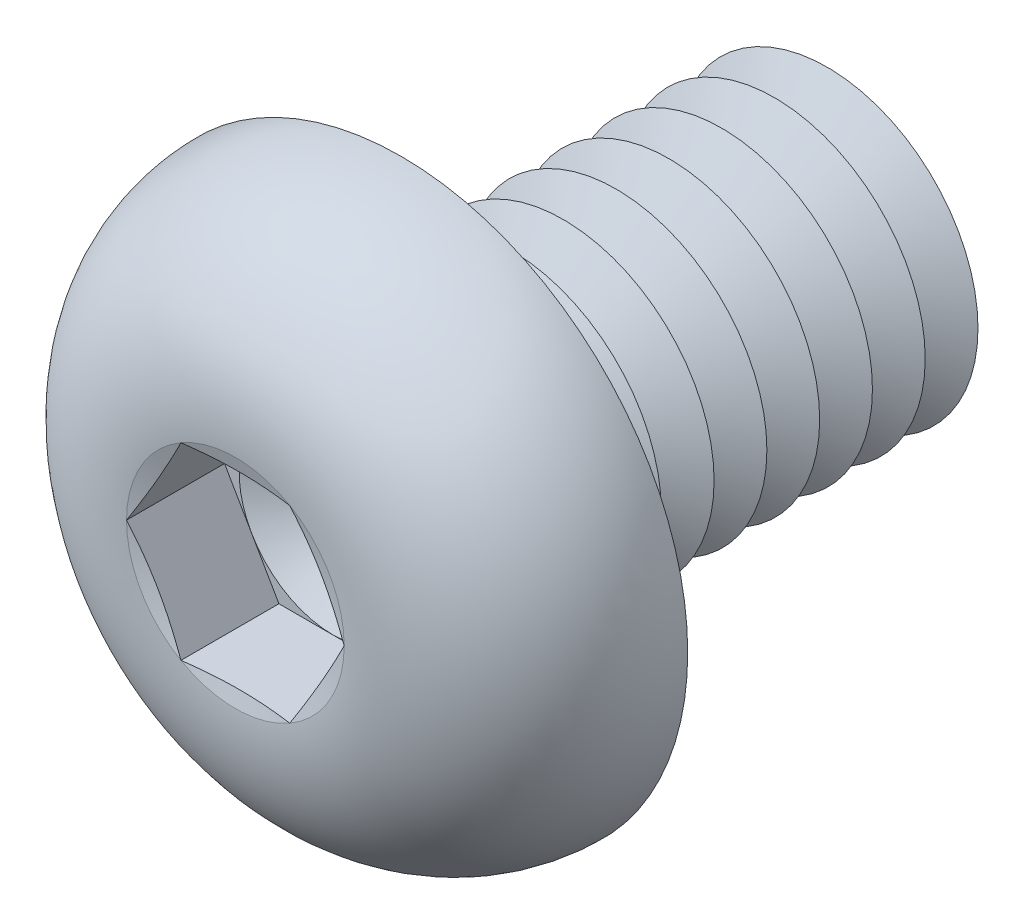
from build123d import *

# Parameters (mm, degrees)
FILLET1_R          = 0.35
LPATTERN1_COUNT    = 8
LPATTERN1_PITCH    = 0.7
CUT_EXTRUDE1_DEPTH = 1.3


with BuildPart() as part:
    # Sketch1 → Revolve1 (revolve)
    with BuildSketch(Plane(origin=(0, 0, 0), x_dir=(0, 0, -1), z_dir=(1, 0, 0)), mode=Mode.PRIVATE) as revolve1_sk:
        with BuildLine():
            Line((0, 2), (0, 3.8))
            ThreePointArc((0, 3.8), (-1.611961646, 3.099623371), (-2.2, 1.443375))
            Line((-2.2, 1.443375), (-2.006624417, 0.7216875))
            Line((-2.006624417, 0.7216875), (-2.2, 0.7216875))
            Line((-2.2, 0.7216875), (-2.2, 0))
            Line((-2.2, 0), (6, 0))
            Line((6, 0), (6, 2))
            Line((6, 2), (0, 2))
        make_face()
    revolve(revolve1_sk.sketch.rotate(Axis((0, 0, -6), (0, 0, 1)), 90), axis=Axis((0, 0, -6), (0, 0, 1)))

    # Fillet1
    fillet1_edges = [part.edges().sort_by_distance(p)[0] for p in [
        (2, 0, 0),
    ]]
    fillet(fillet1_edges, radius=FILLET1_R)

    # Sketch2 → Cut-Revolve1 (revolve, cut)
    with BuildSketch(Plane(origin=(0, 0, 0), x_dir=(0, 0, -1), z_dir=(1, 0, 0)), mode=Mode.PRIVATE) as cut_revolve1_sk:
        Polygon((5.65, 2), (6.35, 2), (6, 1.393782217), align=None)
    cut_revolve1 = revolve(cut_revolve1_sk.sketch.rotate(Axis((0, 0, -6), (0, 0, -1)), 270), axis=Axis((0, 0, -6), (0, 0, -1)), mode=Mode.SUBTRACT)

    # LPattern1: Cut-Revolve1 ×8
    with Locations(*[(0, 0, i * LPATTERN1_PITCH) for i in range(1, LPATTERN1_COUNT)]):
        add(cut_revolve1, mode=Mode.SUBTRACT)

    # Sketch3 → Cut-Extrude1 (cut)
    with BuildSketch(Plane.XY.offset(2.2)):
        Polygon((0.7216875, 1.249999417), (-0.7216875, 1.249999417), (-1.443375, 0), (-0.7216875, -1.249999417), (0.7216875, -1.249999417), (1.443375, 0), align=None)
    extrude(amount=-CUT_EXTRUDE1_DEPTH, mode=Mode.SUBTRACT)

    # Cut-Extrude2 cone 1 section (on through the dimple's axis) → Cut-Extrude2 (revolve, cut)
    with BuildSketch(Plane(origin=(0, 0, 0.9), x_dir=(0, -1, 0), z_dir=(1, 0, 0))):
        Polygon((0, 0), (1.249999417, 0), (0, 0.7216875), align=None)
    revolve(axis=Axis((0, 0, 0.9), (0, 0, -1)), mode=Mode.SUBTRACT)


solid = part.part
